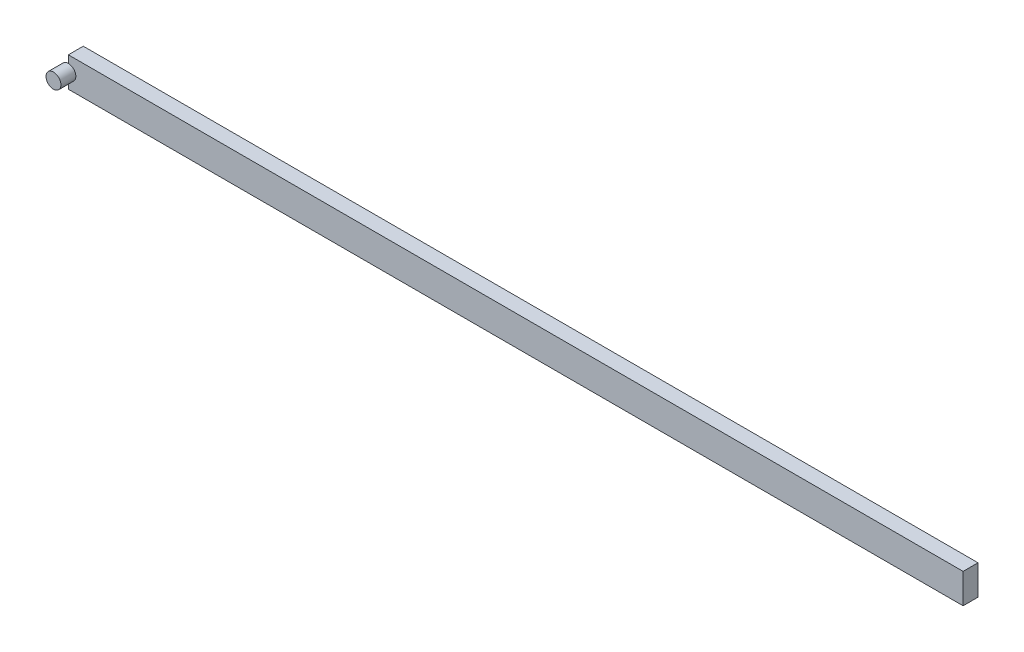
from build123d import *

# Parameters (mm, degrees)
BOSS_EXTRUDE1_DEPTH      = 10
BOSS_EXTRUDE1_DEPTH_BACK = 10
SKETCH1_W                = 1200
SKETCH1_H                = 40
SKETCH3_R                = 10
BOSS_EXTRUDE3_DEPTH      = 20


with BuildPart() as part:
    # Sketch1 → Boss-Extrude1 (new, two sides: drawn at the far end of the back side and taken through both)
    with BuildSketch(Plane.XY.offset(-BOSS_EXTRUDE1_DEPTH_BACK)):
        Rectangle(SKETCH1_W, SKETCH1_H)
    extrude(amount=BOSS_EXTRUDE1_DEPTH + BOSS_EXTRUDE1_DEPTH_BACK)

    # Sketch3 → Boss-Extrude3 (add)
    with BuildSketch(Plane.XY.offset(10)):
        with Locations(Location((-600, 0, 0), (0, 0, 270))):
            Circle(SKETCH3_R)
    extrude(amount=BOSS_EXTRUDE3_DEPTH)


solid = part.part
